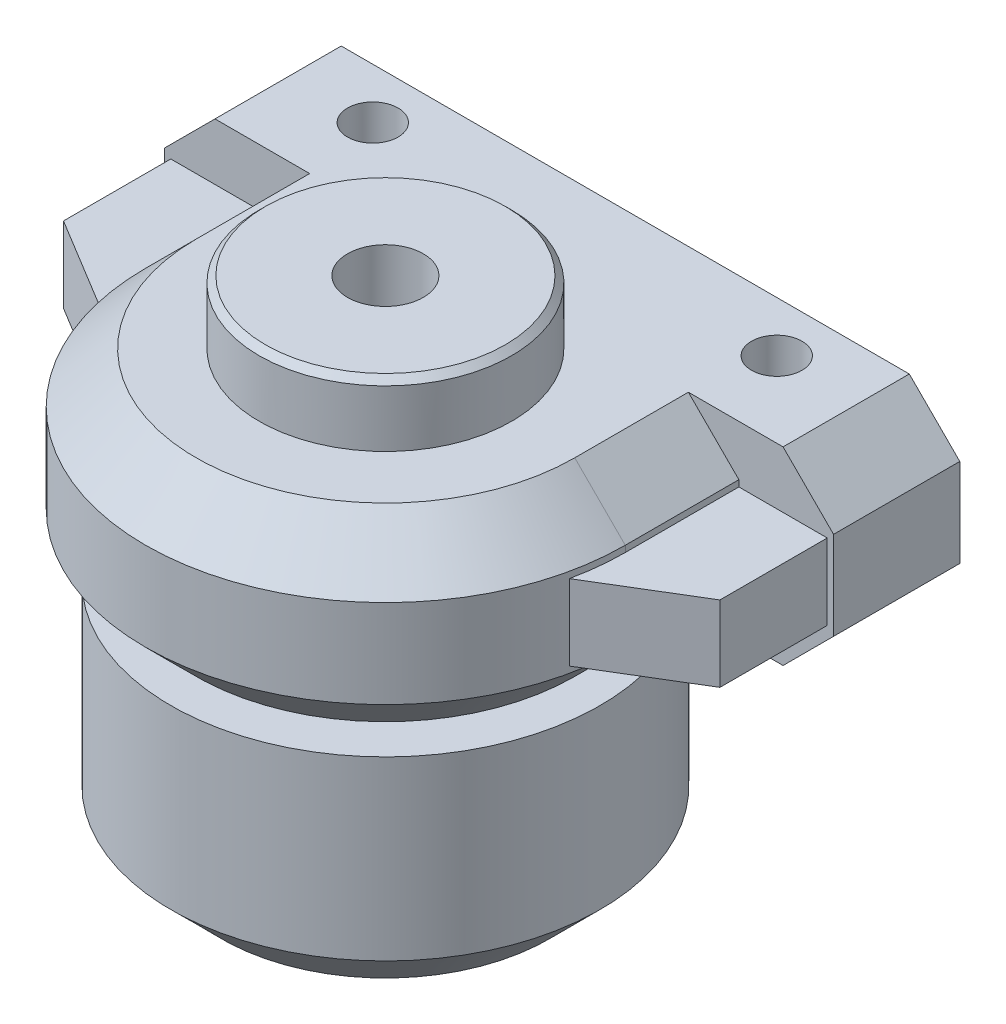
ISO-10303-21;
HEADER;
FILE_DESCRIPTION(('STEP AP214'),'2;1');
FILE_NAME('part.step','',(''),(''),'','','');
FILE_SCHEMA(('AUTOMOTIVE_DESIGN { 1 0 10303 214 1 1 1 1 }'));
ENDSEC;
DATA;
#1=APPLICATION_CONTEXT('core data for automotive mechanical design processes');
#2=APPLICATION_PROTOCOL_DEFINITION('international standard','automotive_design',2000,#1);
#3=PRODUCT_CONTEXT('',#1,'mechanical');
#4=PRODUCT('Part','Part','',(#3));
#5=PRODUCT_RELATED_PRODUCT_CATEGORY('part','',(#4));
#6=PRODUCT_DEFINITION_FORMATION('','',#4);
#7=PRODUCT_DEFINITION_CONTEXT('part definition',#1,'design');
#8=PRODUCT_DEFINITION('design','',#6,#7);
#9=PRODUCT_DEFINITION_SHAPE('','',#8);
#10=(LENGTH_UNIT() NAMED_UNIT(*) SI_UNIT(.MILLI.,.METRE.));
#11=(NAMED_UNIT(*) PLANE_ANGLE_UNIT() SI_UNIT($,.RADIAN.));
#12=(NAMED_UNIT(*) SI_UNIT($,.STERADIAN.) SOLID_ANGLE_UNIT());
#13=UNCERTAINTY_MEASURE_WITH_UNIT(LENGTH_MEASURE(1.E-05),#10,'distance_accuracy_value','');
#14=(GEOMETRIC_REPRESENTATION_CONTEXT(3) GLOBAL_UNCERTAINTY_ASSIGNED_CONTEXT((#13)) GLOBAL_UNIT_ASSIGNED_CONTEXT((#10,
#11,#12)) REPRESENTATION_CONTEXT('',''));
#15=CARTESIAN_POINT('',(0.,0.,0.));
#16=DIRECTION('',(0.,0.,1.));
#17=DIRECTION('',(1.,0.,0.));
#18=AXIS2_PLACEMENT_3D('',#15,#16,#17);
#19=CARTESIAN_POINT('',(0.,15.,10.));
#20=DIRECTION('',(0.,-1.,0.));
#21=DIRECTION('',(0.,0.,-1.));
#22=AXIS2_PLACEMENT_3D('',#19,#20,#21);
#23=PLANE('',#22);
#24=CARTESIAN_POINT('',(10.5,15.,4.));
#25=DIRECTION('',(0.,1.,0.));
#26=DIRECTION('',(0.,0.,-1.));
#27=AXIS2_PLACEMENT_3D('',#24,#25,#26);
#28=CIRCLE('',#27,2.);
#29=CARTESIAN_POINT('',(10.5,15.,2.));
#30=VERTEX_POINT('',#29);
#31=EDGE_CURVE('E346',#30,#30,#28,.T.);
#32=ORIENTED_EDGE('',*,*,#31,.F.);
#33=EDGE_LOOP('',(#32));
#34=FACE_BOUND('',#33,.T.);
#35=CARTESIAN_POINT('',(42.5,15.,4.));
#36=DIRECTION('',(0.,1.,0.));
#37=DIRECTION('',(0.,0.,1.));
#38=AXIS2_PLACEMENT_3D('',#35,#36,#37);
#39=CIRCLE('',#38,2.);
#40=CARTESIAN_POINT('',(42.5,15.,6.));
#41=VERTEX_POINT('',#40);
#42=EDGE_CURVE('E336',#41,#41,#39,.T.);
#43=ORIENTED_EDGE('',*,*,#42,.F.);
#44=EDGE_LOOP('',(#43));
#45=FACE_BOUND('',#44,.T.);
#46=DIRECTION('',(-1.,0.,0.));
#47=VECTOR('',#46,1.);
#48=CARTESIAN_POINT('',(0.,15.,10.));
#49=LINE('',#48,#47);
#50=CARTESIAN_POINT('',(49.,15.,10.));
#51=VERTEX_POINT('',#50);
#52=CARTESIAN_POINT('',(41.5,15.,10.));
#53=VERTEX_POINT('',#52);
#54=EDGE_CURVE('E416',#51,#53,#49,.T.);
#55=ORIENTED_EDGE('',*,*,#54,.F.);
#56=DIRECTION('',(0.,0.,-1.));
#57=VECTOR('',#56,1.);
#58=CARTESIAN_POINT('',(49.,15.,10.));
#59=LINE('',#58,#57);
#60=CARTESIAN_POINT('',(49.,15.,0.));
#61=VERTEX_POINT('',#60);
#62=EDGE_CURVE('E513',#51,#61,#59,.T.);
#63=ORIENTED_EDGE('',*,*,#62,.T.);
#64=DIRECTION('',(-1.,0.,0.));
#65=VECTOR('',#64,1.);
#66=CARTESIAN_POINT('',(0.,15.,0.));
#67=LINE('',#66,#65);
#68=CARTESIAN_POINT('',(4.00000000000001,15.,0.));
#69=VERTEX_POINT('',#68);
#70=EDGE_CURVE('E547',#61,#69,#67,.T.);
#71=ORIENTED_EDGE('',*,*,#70,.T.);
#72=DIRECTION('',(0.,0.,1.));
#73=VECTOR('',#72,1.);
#74=CARTESIAN_POINT('',(4.00000000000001,15.,10.));
#75=LINE('',#74,#73);
#76=CARTESIAN_POINT('',(4.00000000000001,15.,10.));
#77=VERTEX_POINT('',#76);
#78=EDGE_CURVE('E511',#69,#77,#75,.T.);
#79=ORIENTED_EDGE('',*,*,#78,.T.);
#80=CARTESIAN_POINT('',(11.5,15.,10.));
#81=VERTEX_POINT('',#80);
#82=EDGE_CURVE('E421',#81,#77,#49,.T.);
#83=ORIENTED_EDGE('',*,*,#82,.F.);
#84=DIRECTION('',(0.,0.,1.));
#85=VECTOR('',#84,1.);
#86=CARTESIAN_POINT('',(11.5,15.,19.));
#87=LINE('',#86,#85);
#88=CARTESIAN_POINT('',(11.5,15.,19.));
#89=VERTEX_POINT('',#88);
#90=EDGE_CURVE('E456',#81,#89,#87,.T.);
#91=ORIENTED_EDGE('',*,*,#90,.T.);
#92=CARTESIAN_POINT('',(26.5,15.,19.));
#93=DIRECTION('',(0.,-1.,0.));
#94=DIRECTION('',(0.,0.,-1.));
#95=AXIS2_PLACEMENT_3D('',#92,#93,#94);
#96=CIRCLE('',#95,15.);
#97=CARTESIAN_POINT('',(41.5,15.,19.));
#98=VERTEX_POINT('',#97);
#99=EDGE_CURVE('E460',#89,#98,#96,.F.);
#100=ORIENTED_EDGE('',*,*,#99,.T.);
#101=DIRECTION('',(0.,0.,-1.));
#102=VECTOR('',#101,1.);
#103=CARTESIAN_POINT('',(41.5,15.,10.));
#104=LINE('',#103,#102);
#105=EDGE_CURVE('E462',#98,#53,#104,.T.);
#106=ORIENTED_EDGE('',*,*,#105,.T.);
#107=EDGE_LOOP('',(#55,#63,#71,#79,#83,#91,#100,#106));
#108=FACE_BOUND('',#107,.T.);
#109=CARTESIAN_POINT('',(26.5,15.,19.));
#110=DIRECTION('',(0.,-1.,0.));
#111=DIRECTION('',(0.,0.,-1.));
#112=AXIS2_PLACEMENT_3D('',#109,#110,#111);
#113=CIRCLE('',#112,10.);
#114=CARTESIAN_POINT('',(26.5,15.,9.));
#115=VERTEX_POINT('',#114);
#116=EDGE_CURVE('E328',#115,#115,#113,.F.);
#117=ORIENTED_EDGE('',*,*,#116,.F.);
#118=EDGE_LOOP('',(#117));
#119=FACE_BOUND('',#118,.T.);
#120=ADVANCED_FACE('F24',(#34,#45,#108,#119),#23,.F.);
#121=CARTESIAN_POINT('',(0.,15.,10.));
#122=DIRECTION('',(0.,0.,-1.));
#123=DIRECTION('',(-1.,0.,0.));
#124=AXIS2_PLACEMENT_3D('',#121,#122,#123);
#125=PLANE('',#124);
#126=DIRECTION('',(-1.,0.,0.));
#127=VECTOR('',#126,1.);
#128=CARTESIAN_POINT('',(0.499999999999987,10.5,10.));
#129=LINE('',#128,#127);
#130=CARTESIAN_POINT('',(7.49999999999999,10.5,10.));
#131=VERTEX_POINT('',#130);
#132=CARTESIAN_POINT('',(0.499999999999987,10.5,10.));
#133=VERTEX_POINT('',#132);
#134=EDGE_CURVE('E238',#131,#133,#129,.T.);
#135=ORIENTED_EDGE('',*,*,#134,.F.);
#136=DIRECTION('',(0.,1.,0.));
#137=VECTOR('',#136,1.);
#138=CARTESIAN_POINT('',(7.49999999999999,0.,10.));
#139=LINE('',#138,#137);
#140=CARTESIAN_POINT('',(7.49999999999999,11.,10.));
#141=VERTEX_POINT('',#140);
#142=EDGE_CURVE('E322',#131,#141,#139,.T.);
#143=ORIENTED_EDGE('',*,*,#142,.T.);
#144=DIRECTION('',(0.707106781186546,0.707106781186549,0.));
#145=VECTOR('',#144,1.);
#146=CARTESIAN_POINT('',(5.75000000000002,9.25,10.));
#147=LINE('',#146,#145);
#148=EDGE_CURVE('E473',#141,#81,#147,.T.);
#149=ORIENTED_EDGE('',*,*,#148,.T.);
#150=ORIENTED_EDGE('',*,*,#82,.T.);
#151=DIRECTION('',(0.707106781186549,0.707106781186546,0.));
#152=VECTOR('',#151,1.);
#153=CARTESIAN_POINT('',(0.,11.,10.));
#154=LINE('',#153,#152);
#155=CARTESIAN_POINT('',(0.,11.,10.));
#156=VERTEX_POINT('',#155);
#157=EDGE_CURVE('E521',#77,#156,#154,.F.);
#158=ORIENTED_EDGE('',*,*,#157,.T.);
#159=DIRECTION('',(0.,-1.,0.));
#160=VECTOR('',#159,1.);
#161=CARTESIAN_POINT('',(0.,0.,10.));
#162=LINE('',#161,#160);
#163=CARTESIAN_POINT('',(0.,4.00000000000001,10.));
#164=VERTEX_POINT('',#163);
#165=EDGE_CURVE('E499',#156,#164,#162,.T.);
#166=ORIENTED_EDGE('',*,*,#165,.T.);
#167=DIRECTION('',(-0.707106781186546,0.707106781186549,0.));
#168=VECTOR('',#167,1.);
#169=CARTESIAN_POINT('',(4.,0.,10.));
#170=LINE('',#169,#168);
#171=CARTESIAN_POINT('',(4.,0.,10.));
#172=VERTEX_POINT('',#171);
#173=EDGE_CURVE('E331',#164,#172,#170,.F.);
#174=ORIENTED_EDGE('',*,*,#173,.T.);
#175=DIRECTION('',(1.,0.,0.));
#176=VECTOR('',#175,1.);
#177=CARTESIAN_POINT('',(0.,0.,10.));
#178=LINE('',#177,#176);
#179=CARTESIAN_POINT('',(11.5,0.,10.));
#180=VERTEX_POINT('',#179);
#181=EDGE_CURVE('E490',#172,#180,#178,.T.);
#182=ORIENTED_EDGE('',*,*,#181,.T.);
#183=DIRECTION('',(-0.707106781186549,0.707106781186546,0.));
#184=VECTOR('',#183,1.);
#185=CARTESIAN_POINT('',(-1.75000000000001,13.25,10.));
#186=LINE('',#185,#184);
#187=CARTESIAN_POINT('',(7.49999999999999,4.,10.));
#188=VERTEX_POINT('',#187);
#189=EDGE_CURVE('E468',#180,#188,#186,.T.);
#190=ORIENTED_EDGE('',*,*,#189,.T.);
#191=CARTESIAN_POINT('',(7.49999999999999,4.49999999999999,10.));
#192=VERTEX_POINT('',#191);
#193=EDGE_CURVE('E318',#188,#192,#139,.T.);
#194=ORIENTED_EDGE('',*,*,#193,.T.);
#195=DIRECTION('',(-1.,0.,0.));
#196=VECTOR('',#195,1.);
#197=CARTESIAN_POINT('',(0.499999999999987,4.49999999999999,10.));
#198=LINE('',#197,#196);
#199=CARTESIAN_POINT('',(0.499999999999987,4.49999999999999,10.));
#200=VERTEX_POINT('',#199);
#201=EDGE_CURVE('E46',#192,#200,#198,.T.);
#202=ORIENTED_EDGE('',*,*,#201,.T.);
#203=DIRECTION('',(0.,-1.,0.));
#204=VECTOR('',#203,1.);
#205=CARTESIAN_POINT('',(0.499999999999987,10.5,10.));
#206=LINE('',#205,#204);
#207=EDGE_CURVE('E41',#133,#200,#206,.T.);
#208=ORIENTED_EDGE('',*,*,#207,.F.);
#209=EDGE_LOOP('',(#135,#143,#149,#150,#158,#166,#174,#182,#190,#194,#202,#208));
#210=FACE_BOUND('',#209,.T.);
#211=ADVANCED_FACE('F374',(#210),#125,.F.);
#212=CARTESIAN_POINT('',(26.5,0.,19.));
#213=DIRECTION('',(0.,1.,0.));
#214=DIRECTION('',(0.,0.,1.));
#215=AXIS2_PLACEMENT_3D('',#212,#213,#214);
#216=CYLINDRICAL_SURFACE('',#215,19.);
#217=DIRECTION('',(0.,1.,0.));
#218=VECTOR('',#217,1.);
#219=CARTESIAN_POINT('',(7.49999999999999,0.,19.));
#220=LINE('',#219,#218);
#221=CARTESIAN_POINT('',(7.49999999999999,10.5,19.));
#222=VERTEX_POINT('',#221);
#223=CARTESIAN_POINT('',(7.49999999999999,11.,19.));
#224=VERTEX_POINT('',#223);
#225=EDGE_CURVE('E208',#222,#224,#220,.T.);
#226=ORIENTED_EDGE('',*,*,#225,.F.);
#227=CARTESIAN_POINT('',(26.5,10.5,19.));
#228=DIRECTION('',(0.,-1.,0.));
#229=DIRECTION('',(0.,0.,-1.));
#230=AXIS2_PLACEMENT_3D('',#227,#228,#229);
#231=CIRCLE('',#230,19.);
#232=CARTESIAN_POINT('',(7.92582437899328,10.5,23.));
#233=VERTEX_POINT('',#232);
#234=EDGE_CURVE('E232',#233,#222,#231,.T.);
#235=ORIENTED_EDGE('',*,*,#234,.F.);
#236=DIRECTION('',(0.,-1.,0.));
#237=VECTOR('',#236,1.);
#238=CARTESIAN_POINT('',(7.92582437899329,10.5,23.));
#239=LINE('',#238,#237);
#240=CARTESIAN_POINT('',(7.92582437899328,4.49999999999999,23.));
#241=VERTEX_POINT('',#240);
#242=EDGE_CURVE('E215',#233,#241,#239,.T.);
#243=ORIENTED_EDGE('',*,*,#242,.T.);
#244=CARTESIAN_POINT('',(26.5,4.49999999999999,19.));
#245=DIRECTION('',(0.,-1.,0.));
#246=DIRECTION('',(0.,0.,-1.));
#247=AXIS2_PLACEMENT_3D('',#244,#245,#246);
#248=CIRCLE('',#247,19.);
#249=CARTESIAN_POINT('',(7.49999999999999,4.49999999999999,19.));
#250=VERTEX_POINT('',#249);
#251=EDGE_CURVE('E211',#241,#250,#248,.T.);
#252=ORIENTED_EDGE('',*,*,#251,.T.);
#253=CARTESIAN_POINT('',(7.49999999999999,4.,19.));
#254=VERTEX_POINT('',#253);
#255=EDGE_CURVE('E197',#254,#250,#220,.T.);
#256=ORIENTED_EDGE('',*,*,#255,.F.);
#257=CARTESIAN_POINT('',(26.5,4.,19.));
#258=DIRECTION('',(0.,1.,0.));
#259=DIRECTION('',(0.,0.,1.));
#260=AXIS2_PLACEMENT_3D('',#257,#258,#259);
#261=CIRCLE('',#260,19.);
#262=CARTESIAN_POINT('',(45.5,4.,19.));
#263=VERTEX_POINT('',#262);
#264=EDGE_CURVE('E446',#254,#263,#261,.T.);
#265=ORIENTED_EDGE('',*,*,#264,.T.);
#266=DIRECTION('',(0.,1.,0.));
#267=VECTOR('',#266,1.);
#268=CARTESIAN_POINT('',(45.5,0.,19.));
#269=LINE('',#268,#267);
#270=CARTESIAN_POINT('',(45.5,4.49999999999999,19.));
#271=VERTEX_POINT('',#270);
#272=EDGE_CURVE('E553',#263,#271,#269,.T.);
#273=ORIENTED_EDGE('',*,*,#272,.T.);
#274=CARTESIAN_POINT('',(26.5,4.49999999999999,19.));
#275=DIRECTION('',(0.,-1.,0.));
#276=DIRECTION('',(0.,0.,1.));
#277=AXIS2_PLACEMENT_3D('',#274,#275,#276);
#278=CIRCLE('',#277,19.);
#279=CARTESIAN_POINT('',(45.0741756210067,4.49999999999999,23.));
#280=VERTEX_POINT('',#279);
#281=EDGE_CURVE('E255',#271,#280,#278,.T.);
#282=ORIENTED_EDGE('',*,*,#281,.T.);
#283=DIRECTION('',(0.,-1.,0.));
#284=VECTOR('',#283,1.);
#285=CARTESIAN_POINT('',(45.0741756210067,10.5,23.));
#286=LINE('',#285,#284);
#287=CARTESIAN_POINT('',(45.0741756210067,10.5,23.));
#288=VERTEX_POINT('',#287);
#289=EDGE_CURVE('E279',#288,#280,#286,.T.);
#290=ORIENTED_EDGE('',*,*,#289,.F.);
#291=CARTESIAN_POINT('',(26.5,10.5,19.));
#292=DIRECTION('',(0.,-1.,0.));
#293=DIRECTION('',(0.,0.,1.));
#294=AXIS2_PLACEMENT_3D('',#291,#292,#293);
#295=CIRCLE('',#294,19.);
#296=CARTESIAN_POINT('',(45.5,10.5,19.));
#297=VERTEX_POINT('',#296);
#298=EDGE_CURVE('E268',#297,#288,#295,.T.);
#299=ORIENTED_EDGE('',*,*,#298,.F.);
#300=CARTESIAN_POINT('',(45.5,11.,19.));
#301=VERTEX_POINT('',#300);
#302=EDGE_CURVE('E310',#297,#301,#269,.T.);
#303=ORIENTED_EDGE('',*,*,#302,.T.);
#304=CARTESIAN_POINT('',(26.5,11.,19.));
#305=DIRECTION('',(0.,-1.,0.));
#306=DIRECTION('',(0.,0.,-1.));
#307=AXIS2_PLACEMENT_3D('',#304,#305,#306);
#308=CIRCLE('',#307,19.);
#309=EDGE_CURVE('E444',#301,#224,#308,.T.);
#310=ORIENTED_EDGE('',*,*,#309,.T.);
#311=EDGE_LOOP('',(#226,#235,#243,#252,#256,#265,#273,#282,#290,#299,#303,#310));
#312=FACE_BOUND('',#311,.T.);
#313=ADVANCED_FACE('F213',(#312),#216,.T.);
#314=CARTESIAN_POINT('',(7.49999999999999,0.,10.));
#315=DIRECTION('',(-1.,0.,0.));
#316=DIRECTION('',(0.,0.,1.));
#317=AXIS2_PLACEMENT_3D('',#314,#315,#316);
#318=PLANE('',#317);
#319=ORIENTED_EDGE('',*,*,#142,.F.);
#320=DIRECTION('',(0.,0.,-1.));
#321=VECTOR('',#320,1.);
#322=CARTESIAN_POINT('',(7.49999999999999,10.5,10.));
#323=LINE('',#322,#321);
#324=EDGE_CURVE('E235',#222,#131,#323,.T.);
#325=ORIENTED_EDGE('',*,*,#324,.F.);
#326=ORIENTED_EDGE('',*,*,#225,.T.);
#327=DIRECTION('',(0.,0.,-1.));
#328=VECTOR('',#327,1.);
#329=CARTESIAN_POINT('',(7.49999999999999,11.,10.));
#330=LINE('',#329,#328);
#331=EDGE_CURVE('E447',#224,#141,#330,.T.);
#332=ORIENTED_EDGE('',*,*,#331,.T.);
#333=EDGE_LOOP('',(#319,#325,#326,#332));
#334=FACE_BOUND('',#333,.T.);
#335=ADVANCED_FACE('F399',(#334),#318,.T.);
#336=CARTESIAN_POINT('',(45.5,0.,10.));
#337=DIRECTION('',(1.,0.,0.));
#338=DIRECTION('',(0.,0.,-1.));
#339=AXIS2_PLACEMENT_3D('',#336,#337,#338);
#340=PLANE('',#339);
#341=DIRECTION('',(0.,1.,0.));
#342=VECTOR('',#341,1.);
#343=CARTESIAN_POINT('',(45.5,0.,10.));
#344=LINE('',#343,#342);
#345=CARTESIAN_POINT('',(45.5,4.,10.));
#346=VERTEX_POINT('',#345);
#347=CARTESIAN_POINT('',(45.5,4.49999999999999,10.));
#348=VERTEX_POINT('',#347);
#349=EDGE_CURVE('E325',#346,#348,#344,.T.);
#350=ORIENTED_EDGE('',*,*,#349,.T.);
#351=DIRECTION('',(0.,0.,1.));
#352=VECTOR('',#351,1.);
#353=CARTESIAN_POINT('',(45.5,4.49999999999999,10.));
#354=LINE('',#353,#352);
#355=EDGE_CURVE('E252',#348,#271,#354,.T.);
#356=ORIENTED_EDGE('',*,*,#355,.T.);
#357=ORIENTED_EDGE('',*,*,#272,.F.);
#358=DIRECTION('',(0.,0.,-1.));
#359=VECTOR('',#358,1.);
#360=CARTESIAN_POINT('',(45.5,4.,10.));
#361=LINE('',#360,#359);
#362=EDGE_CURVE('E434',#263,#346,#361,.T.);
#363=ORIENTED_EDGE('',*,*,#362,.T.);
#364=EDGE_LOOP('',(#350,#356,#357,#363));
#365=FACE_BOUND('',#364,.T.);
#366=ADVANCED_FACE('F392',(#365),#340,.T.);
#367=CARTESIAN_POINT('',(0.,0.,10.));
#368=DIRECTION('',(0.,1.,0.));
#369=DIRECTION('',(0.,0.,1.));
#370=AXIS2_PLACEMENT_3D('',#367,#368,#369);
#371=PLANE('',#370);
#372=CARTESIAN_POINT('',(10.5,0.,4.));
#373=DIRECTION('',(0.,1.,0.));
#374=DIRECTION('',(0.,0.,1.));
#375=AXIS2_PLACEMENT_3D('',#372,#373,#374);
#376=CIRCLE('',#375,2.);
#377=CARTESIAN_POINT('',(10.5,0.,6.));
#378=VERTEX_POINT('',#377);
#379=EDGE_CURVE('E28',#378,#378,#376,.T.);
#380=ORIENTED_EDGE('',*,*,#379,.T.);
#381=EDGE_LOOP('',(#380));
#382=FACE_BOUND('',#381,.T.);
#383=CARTESIAN_POINT('',(42.5,0.,4.));
#384=DIRECTION('',(0.,1.,0.));
#385=DIRECTION('',(0.,0.,1.));
#386=AXIS2_PLACEMENT_3D('',#383,#384,#385);
#387=CIRCLE('',#386,2.);
#388=CARTESIAN_POINT('',(42.5,0.,6.));
#389=VERTEX_POINT('',#388);
#390=EDGE_CURVE('E333',#389,#389,#387,.T.);
#391=ORIENTED_EDGE('',*,*,#390,.T.);
#392=EDGE_LOOP('',(#391));
#393=FACE_BOUND('',#392,.T.);
#394=DIRECTION('',(1.,0.,0.));
#395=VECTOR('',#394,1.);
#396=CARTESIAN_POINT('',(0.,0.,0.));
#397=LINE('',#396,#395);
#398=CARTESIAN_POINT('',(4.,0.,0.));
#399=VERTEX_POINT('',#398);
#400=CARTESIAN_POINT('',(49.,0.,0.));
#401=VERTEX_POINT('',#400);
#402=EDGE_CURVE('E409',#399,#401,#397,.T.);
#403=ORIENTED_EDGE('',*,*,#402,.T.);
#404=DIRECTION('',(0.,0.,1.));
#405=VECTOR('',#404,1.);
#406=CARTESIAN_POINT('',(49.,0.,10.));
#407=LINE('',#406,#405);
#408=CARTESIAN_POINT('',(49.,0.,10.));
#409=VERTEX_POINT('',#408);
#410=EDGE_CURVE('E506',#401,#409,#407,.T.);
#411=ORIENTED_EDGE('',*,*,#410,.T.);
#412=CARTESIAN_POINT('',(41.5,0.,10.));
#413=VERTEX_POINT('',#412);
#414=EDGE_CURVE('E494',#413,#409,#178,.T.);
#415=ORIENTED_EDGE('',*,*,#414,.F.);
#416=DIRECTION('',(0.,0.,1.));
#417=VECTOR('',#416,1.);
#418=CARTESIAN_POINT('',(41.5,0.,19.));
#419=LINE('',#418,#417);
#420=CARTESIAN_POINT('',(41.5,0.,19.));
#421=VERTEX_POINT('',#420);
#422=EDGE_CURVE('E442',#413,#421,#419,.T.);
#423=ORIENTED_EDGE('',*,*,#422,.T.);
#424=CARTESIAN_POINT('',(26.5,0.,19.));
#425=DIRECTION('',(0.,1.,0.));
#426=DIRECTION('',(0.,0.,1.));
#427=AXIS2_PLACEMENT_3D('',#424,#425,#426);
#428=CIRCLE('',#427,15.);
#429=CARTESIAN_POINT('',(11.5,0.,19.));
#430=VERTEX_POINT('',#429);
#431=EDGE_CURVE('E440',#421,#430,#428,.F.);
#432=ORIENTED_EDGE('',*,*,#431,.T.);
#433=DIRECTION('',(0.,0.,-1.));
#434=VECTOR('',#433,1.);
#435=CARTESIAN_POINT('',(11.5,0.,10.));
#436=LINE('',#435,#434);
#437=EDGE_CURVE('E437',#430,#180,#436,.T.);
#438=ORIENTED_EDGE('',*,*,#437,.T.);
#439=ORIENTED_EDGE('',*,*,#181,.F.);
#440=DIRECTION('',(0.,0.,-1.));
#441=VECTOR('',#440,1.);
#442=CARTESIAN_POINT('',(4.,0.,10.));
#443=LINE('',#442,#441);
#444=EDGE_CURVE('E489',#172,#399,#443,.T.);
#445=ORIENTED_EDGE('',*,*,#444,.T.);
#446=EDGE_LOOP('',(#403,#411,#415,#423,#432,#438,#439,#445));
#447=FACE_BOUND('',#446,.T.);
#448=CARTESIAN_POINT('',(26.5,0.,19.));
#449=DIRECTION('',(0.,1.,0.));
#450=DIRECTION('',(0.,0.,1.));
#451=AXIS2_PLACEMENT_3D('',#448,#449,#450);
#452=CIRCLE('',#451,9.5);
#453=CARTESIAN_POINT('',(26.5,0.,28.5));
#454=VERTEX_POINT('',#453);
#455=EDGE_CURVE('E413',#454,#454,#452,.F.);
#456=ORIENTED_EDGE('',*,*,#455,.F.);
#457=EDGE_LOOP('',(#456));
#458=FACE_BOUND('',#457,.T.);
#459=ADVANCED_FACE('F390',(#382,#393,#447,#458),#371,.F.);
#460=CARTESIAN_POINT('',(45.5,10.5,10.));
#461=VERTEX_POINT('',#460);
#462=CARTESIAN_POINT('',(45.5,11.,10.));
#463=VERTEX_POINT('',#462);
#464=EDGE_CURVE('E326',#461,#463,#344,.T.);
#465=ORIENTED_EDGE('',*,*,#464,.F.);
#466=DIRECTION('',(-1.,0.,0.));
#467=VECTOR('',#466,1.);
#468=CARTESIAN_POINT('',(52.5,10.5,10.));
#469=LINE('',#468,#467);
#470=CARTESIAN_POINT('',(52.5,10.5,10.));
#471=VERTEX_POINT('',#470);
#472=EDGE_CURVE('E264',#471,#461,#469,.T.);
#473=ORIENTED_EDGE('',*,*,#472,.F.);
#474=DIRECTION('',(0.,-1.,0.));
#475=VECTOR('',#474,1.);
#476=CARTESIAN_POINT('',(52.5,10.5,10.));
#477=LINE('',#476,#475);
#478=CARTESIAN_POINT('',(52.5,4.49999999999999,10.));
#479=VERTEX_POINT('',#478);
#480=EDGE_CURVE('E274',#471,#479,#477,.T.);
#481=ORIENTED_EDGE('',*,*,#480,.T.);
#482=DIRECTION('',(-1.,0.,0.));
#483=VECTOR('',#482,1.);
#484=CARTESIAN_POINT('',(52.5,4.49999999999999,10.));
#485=LINE('',#484,#483);
#486=EDGE_CURVE('E249',#479,#348,#485,.T.);
#487=ORIENTED_EDGE('',*,*,#486,.T.);
#488=ORIENTED_EDGE('',*,*,#349,.F.);
#489=DIRECTION('',(-0.707106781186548,-0.707106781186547,0.));
#490=VECTOR('',#489,1.);
#491=CARTESIAN_POINT('',(28.2499999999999,-13.25,10.));
#492=LINE('',#491,#490);
#493=EDGE_CURVE('E465',#346,#413,#492,.T.);
#494=ORIENTED_EDGE('',*,*,#493,.T.);
#495=ORIENTED_EDGE('',*,*,#414,.T.);
#496=DIRECTION('',(-0.707106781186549,-0.707106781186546,0.));
#497=VECTOR('',#496,1.);
#498=CARTESIAN_POINT('',(53.,4.,10.));
#499=LINE('',#498,#497);
#500=CARTESIAN_POINT('',(53.,4.,10.));
#501=VERTEX_POINT('',#500);
#502=EDGE_CURVE('E509',#409,#501,#499,.F.);
#503=ORIENTED_EDGE('',*,*,#502,.T.);
#504=DIRECTION('',(0.,1.,0.));
#505=VECTOR('',#504,1.);
#506=CARTESIAN_POINT('',(53.,0.,10.));
#507=LINE('',#506,#505);
#508=CARTESIAN_POINT('',(53.,11.,10.));
#509=VERTEX_POINT('',#508);
#510=EDGE_CURVE('E493',#501,#509,#507,.T.);
#511=ORIENTED_EDGE('',*,*,#510,.T.);
#512=DIRECTION('',(0.707106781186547,-0.707106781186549,0.));
#513=VECTOR('',#512,1.);
#514=CARTESIAN_POINT('',(49.,15.,10.));
#515=LINE('',#514,#513);
#516=EDGE_CURVE('E507',#509,#51,#515,.F.);
#517=ORIENTED_EDGE('',*,*,#516,.T.);
#518=ORIENTED_EDGE('',*,*,#54,.T.);
#519=DIRECTION('',(0.707106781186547,-0.707106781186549,0.));
#520=VECTOR('',#519,1.);
#521=CARTESIAN_POINT('',(20.7500000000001,35.75,10.));
#522=LINE('',#521,#520);
#523=EDGE_CURVE('E470',#53,#463,#522,.T.);
#524=ORIENTED_EDGE('',*,*,#523,.T.);
#525=EDGE_LOOP('',(#465,#473,#481,#487,#488,#494,#495,#503,#511,#517,#518,#524));
#526=FACE_BOUND('',#525,.T.);
#527=ADVANCED_FACE('F381',(#526),#125,.F.);
#528=CARTESIAN_POINT('',(0.,0.,10.));
#529=DIRECTION('',(1.,0.,0.));
#530=DIRECTION('',(0.,0.,-1.));
#531=AXIS2_PLACEMENT_3D('',#528,#529,#530);
#532=PLANE('',#531);
#533=DIRECTION('',(0.,-1.,0.));
#534=VECTOR('',#533,1.);
#535=CARTESIAN_POINT('',(0.,0.,0.));
#536=LINE('',#535,#534);
#537=CARTESIAN_POINT('',(0.,11.,0.));
#538=VERTEX_POINT('',#537);
#539=CARTESIAN_POINT('',(0.,4.00000000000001,0.));
#540=VERTEX_POINT('',#539);
#541=EDGE_CURVE('E207',#538,#540,#536,.T.);
#542=ORIENTED_EDGE('',*,*,#541,.T.);
#543=DIRECTION('',(0.,0.,1.));
#544=VECTOR('',#543,1.);
#545=CARTESIAN_POINT('',(0.,4.00000000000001,10.));
#546=LINE('',#545,#544);
#547=EDGE_CURVE('E519',#540,#164,#546,.T.);
#548=ORIENTED_EDGE('',*,*,#547,.T.);
#549=ORIENTED_EDGE('',*,*,#165,.F.);
#550=DIRECTION('',(0.,0.,-1.));
#551=VECTOR('',#550,1.);
#552=CARTESIAN_POINT('',(0.,11.,10.));
#553=LINE('',#552,#551);
#554=EDGE_CURVE('E516',#156,#538,#553,.T.);
#555=ORIENTED_EDGE('',*,*,#554,.T.);
#556=EDGE_LOOP('',(#542,#548,#549,#555));
#557=FACE_BOUND('',#556,.T.);
#558=ADVANCED_FACE('F26',(#557),#532,.F.);
#559=CARTESIAN_POINT('',(53.,0.,10.));
#560=DIRECTION('',(-1.,0.,0.));
#561=DIRECTION('',(0.,0.,1.));
#562=AXIS2_PLACEMENT_3D('',#559,#560,#561);
#563=PLANE('',#562);
#564=ORIENTED_EDGE('',*,*,#510,.F.);
#565=DIRECTION('',(0.,0.,-1.));
#566=VECTOR('',#565,1.);
#567=CARTESIAN_POINT('',(53.,4.,10.));
#568=LINE('',#567,#566);
#569=CARTESIAN_POINT('',(53.,4.,0.));
#570=VERTEX_POINT('',#569);
#571=EDGE_CURVE('E478',#501,#570,#568,.T.);
#572=ORIENTED_EDGE('',*,*,#571,.T.);
#573=DIRECTION('',(0.,1.,0.));
#574=VECTOR('',#573,1.);
#575=CARTESIAN_POINT('',(53.,0.,0.));
#576=LINE('',#575,#574);
#577=CARTESIAN_POINT('',(53.,11.,0.));
#578=VERTEX_POINT('',#577);
#579=EDGE_CURVE('E543',#570,#578,#576,.T.);
#580=ORIENTED_EDGE('',*,*,#579,.T.);
#581=DIRECTION('',(0.,0.,1.));
#582=VECTOR('',#581,1.);
#583=CARTESIAN_POINT('',(53.,11.,10.));
#584=LINE('',#583,#582);
#585=EDGE_CURVE('E476',#578,#509,#584,.T.);
#586=ORIENTED_EDGE('',*,*,#585,.T.);
#587=EDGE_LOOP('',(#564,#572,#580,#586));
#588=FACE_BOUND('',#587,.T.);
#589=ADVANCED_FACE('F386',(#588),#563,.F.);
#590=CARTESIAN_POINT('',(0.,15.,0.));
#591=DIRECTION('',(0.,0.,-1.));
#592=DIRECTION('',(-1.,0.,0.));
#593=AXIS2_PLACEMENT_3D('',#590,#591,#592);
#594=PLANE('',#593);
#595=CARTESIAN_POINT('',(47.5,7.5,0.));
#596=DIRECTION('',(0.,0.,-1.));
#597=DIRECTION('',(1.,0.,0.));
#598=AXIS2_PLACEMENT_3D('',#595,#596,#597);
#599=CIRCLE('',#598,1.5);
#600=CARTESIAN_POINT('',(49.,7.5,0.));
#601=VERTEX_POINT('',#600);
#602=EDGE_CURVE('E281',#601,#601,#599,.T.);
#603=ORIENTED_EDGE('',*,*,#602,.F.);
#604=EDGE_LOOP('',(#603));
#605=FACE_BOUND('',#604,.T.);
#606=CARTESIAN_POINT('',(5.5,7.5,0.));
#607=DIRECTION('',(0.,0.,-1.));
#608=DIRECTION('',(-1.,0.,0.));
#609=AXIS2_PLACEMENT_3D('',#606,#607,#608);
#610=CIRCLE('',#609,1.5);
#611=CARTESIAN_POINT('',(4.,7.5,0.));
#612=VERTEX_POINT('',#611);
#613=EDGE_CURVE('E287',#612,#612,#610,.T.);
#614=ORIENTED_EDGE('',*,*,#613,.F.);
#615=EDGE_LOOP('',(#614));
#616=FACE_BOUND('',#615,.T.);
#617=ORIENTED_EDGE('',*,*,#579,.F.);
#618=DIRECTION('',(0.707106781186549,0.707106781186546,0.));
#619=VECTOR('',#618,1.);
#620=CARTESIAN_POINT('',(31.9999999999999,-17.,0.));
#621=LINE('',#620,#619);
#622=EDGE_CURVE('E487',#570,#401,#621,.F.);
#623=ORIENTED_EDGE('',*,*,#622,.T.);
#624=ORIENTED_EDGE('',*,*,#402,.F.);
#625=DIRECTION('',(0.707106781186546,-0.707106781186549,0.));
#626=VECTOR('',#625,1.);
#627=CARTESIAN_POINT('',(-5.49999999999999,9.50000000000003,0.));
#628=LINE('',#627,#626);
#629=EDGE_CURVE('E483',#399,#540,#628,.F.);
#630=ORIENTED_EDGE('',*,*,#629,.T.);
#631=ORIENTED_EDGE('',*,*,#541,.F.);
#632=DIRECTION('',(-0.707106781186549,-0.707106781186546,0.));
#633=VECTOR('',#632,1.);
#634=CARTESIAN_POINT('',(2.,13.,0.));
#635=LINE('',#634,#633);
#636=EDGE_CURVE('E481',#538,#69,#635,.F.);
#637=ORIENTED_EDGE('',*,*,#636,.T.);
#638=ORIENTED_EDGE('',*,*,#70,.F.);
#639=DIRECTION('',(-0.707106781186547,0.707106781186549,0.));
#640=VECTOR('',#639,1.);
#641=CARTESIAN_POINT('',(24.5000000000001,39.5,0.));
#642=LINE('',#641,#640);
#643=EDGE_CURVE('E485',#61,#578,#642,.F.);
#644=ORIENTED_EDGE('',*,*,#643,.T.);
#645=EDGE_LOOP('',(#617,#623,#624,#630,#631,#637,#638,#644));
#646=FACE_BOUND('',#645,.T.);
#647=ADVANCED_FACE('F388',(#605,#616,#646),#594,.T.);
#648=DIRECTION('',(0.,0.,-1.));
#649=VECTOR('',#648,1.);
#650=CARTESIAN_POINT('',(7.49999999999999,4.49999999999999,10.));
#651=LINE('',#650,#649);
#652=EDGE_CURVE('E202',#250,#192,#651,.T.);
#653=ORIENTED_EDGE('',*,*,#652,.T.);
#654=ORIENTED_EDGE('',*,*,#193,.F.);
#655=DIRECTION('',(0.,0.,1.));
#656=VECTOR('',#655,1.);
#657=CARTESIAN_POINT('',(7.49999999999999,4.,19.));
#658=LINE('',#657,#656);
#659=EDGE_CURVE('E204',#188,#254,#658,.T.);
#660=ORIENTED_EDGE('',*,*,#659,.T.);
#661=ORIENTED_EDGE('',*,*,#255,.T.);
#662=EDGE_LOOP('',(#653,#654,#660,#661));
#663=FACE_BOUND('',#662,.T.);
#664=ADVANCED_FACE('F199',(#663),#318,.T.);
#665=DIRECTION('',(0.,0.,1.));
#666=VECTOR('',#665,1.);
#667=CARTESIAN_POINT('',(45.5,10.5,10.));
#668=LINE('',#667,#666);
#669=EDGE_CURVE('E266',#461,#297,#668,.T.);
#670=ORIENTED_EDGE('',*,*,#669,.F.);
#671=ORIENTED_EDGE('',*,*,#464,.T.);
#672=DIRECTION('',(0.,0.,1.));
#673=VECTOR('',#672,1.);
#674=CARTESIAN_POINT('',(45.5,11.,19.));
#675=LINE('',#674,#673);
#676=EDGE_CURVE('E429',#463,#301,#675,.T.);
#677=ORIENTED_EDGE('',*,*,#676,.T.);
#678=ORIENTED_EDGE('',*,*,#302,.F.);
#679=EDGE_LOOP('',(#670,#671,#677,#678));
#680=FACE_BOUND('',#679,.T.);
#681=ADVANCED_FACE('F402',(#680),#340,.T.);
#682=CARTESIAN_POINT('',(26.5,-1.,19.));
#683=DIRECTION('',(0.,1.,0.));
#684=DIRECTION('',(0.,0.,1.));
#685=AXIS2_PLACEMENT_3D('',#682,#683,#684);
#686=CYLINDRICAL_SURFACE('',#685,9.5);
#687=CARTESIAN_POINT('',(26.5,-1.,19.));
#688=DIRECTION('',(0.,-1.,0.));
#689=DIRECTION('',(0.,0.,-1.));
#690=AXIS2_PLACEMENT_3D('',#687,#688,#689);
#691=CIRCLE('',#690,9.5);
#692=CARTESIAN_POINT('',(26.5,-1.,9.5));
#693=VERTEX_POINT('',#692);
#694=EDGE_CURVE('E308',#693,#693,#691,.T.);
#695=ORIENTED_EDGE('',*,*,#694,.F.);
#696=EDGE_LOOP('',(#695));
#697=FACE_BOUND('',#696,.T.);
#698=ORIENTED_EDGE('',*,*,#455,.T.);
#699=EDGE_LOOP('',(#698));
#700=FACE_BOUND('',#699,.T.);
#701=ADVANCED_FACE('F647',(#697,#700),#686,.T.);
#702=CARTESIAN_POINT('',(26.5,-1.,19.));
#703=DIRECTION('',(0.,-1.,0.));
#704=DIRECTION('',(0.,0.,-1.));
#705=AXIS2_PLACEMENT_3D('',#702,#703,#704);
#706=PLANE('',#705);
#707=CARTESIAN_POINT('',(26.5,-1.,19.));
#708=DIRECTION('',(0.,-1.,0.));
#709=DIRECTION('',(0.,0.,-1.));
#710=AXIS2_PLACEMENT_3D('',#707,#708,#709);
#711=CIRCLE('',#710,17.);
#712=CARTESIAN_POINT('',(26.5,-1.,2.));
#713=VERTEX_POINT('',#712);
#714=EDGE_CURVE('E305',#713,#713,#711,.T.);
#715=ORIENTED_EDGE('',*,*,#714,.F.);
#716=EDGE_LOOP('',(#715));
#717=FACE_BOUND('',#716,.T.);
#718=ORIENTED_EDGE('',*,*,#694,.T.);
#719=EDGE_LOOP('',(#718));
#720=FACE_BOUND('',#719,.T.);
#721=ADVANCED_FACE('F653',(#717,#720),#706,.F.);
#722=CARTESIAN_POINT('',(26.5,-19.,19.));
#723=DIRECTION('',(0.,1.,0.));
#724=DIRECTION('',(0.,0.,1.));
#725=AXIS2_PLACEMENT_3D('',#722,#723,#724);
#726=CYLINDRICAL_SURFACE('',#725,17.);
#727=CARTESIAN_POINT('',(26.5,-15.,19.));
#728=DIRECTION('',(0.,-1.,0.));
#729=DIRECTION('',(0.,0.,-1.));
#730=AXIS2_PLACEMENT_3D('',#727,#728,#729);
#731=CIRCLE('',#730,17.);
#732=CARTESIAN_POINT('',(26.5,-15.,2.));
#733=VERTEX_POINT('',#732);
#734=EDGE_CURVE('E419',#733,#733,#731,.F.);
#735=ORIENTED_EDGE('',*,*,#734,.T.);
#736=EDGE_LOOP('',(#735));
#737=FACE_BOUND('',#736,.T.);
#738=ORIENTED_EDGE('',*,*,#714,.T.);
#739=EDGE_LOOP('',(#738));
#740=FACE_BOUND('',#739,.T.);
#741=ADVANCED_FACE('F662',(#737,#740),#726,.T.);
#742=CARTESIAN_POINT('',(26.5,-19.,19.));
#743=DIRECTION('',(0.,-1.,0.));
#744=DIRECTION('',(0.,0.,-1.));
#745=AXIS2_PLACEMENT_3D('',#742,#743,#744);
#746=PLANE('',#745);
#747=CARTESIAN_POINT('',(26.5,-19.,19.));
#748=DIRECTION('',(0.,-1.,0.));
#749=DIRECTION('',(0.,0.,-1.));
#750=AXIS2_PLACEMENT_3D('',#747,#748,#749);
#751=CIRCLE('',#750,13.);
#752=CARTESIAN_POINT('',(26.5,-19.,6.));
#753=VERTEX_POINT('',#752);
#754=EDGE_CURVE('E415',#753,#753,#751,.T.);
#755=ORIENTED_EDGE('',*,*,#754,.T.);
#756=EDGE_LOOP('',(#755));
#757=FACE_BOUND('',#756,.T.);
#758=ADVANCED_FACE('F671',(#757),#746,.T.);
#759=CARTESIAN_POINT('',(26.5,-19.,19.));
#760=DIRECTION('',(0.,1.,0.));
#761=DIRECTION('',(0.,0.,1.));
#762=AXIS2_PLACEMENT_3D('',#759,#760,#761);
#763=CONICAL_SURFACE('',#762,13.,0.785398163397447);
#764=ORIENTED_EDGE('',*,*,#734,.F.);
#765=EDGE_LOOP('',(#764));
#766=FACE_BOUND('',#765,.T.);
#767=ORIENTED_EDGE('',*,*,#754,.F.);
#768=EDGE_LOOP('',(#767));
#769=FACE_BOUND('',#768,.T.);
#770=ADVANCED_FACE('F678',(#766,#769),#763,.T.);
#771=CARTESIAN_POINT('',(7.49999999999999,4.,10.));
#772=DIRECTION('',(-0.707106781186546,-0.707106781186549,0.));
#773=DIRECTION('',(0.707106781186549,-0.707106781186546,0.));
#774=AXIS2_PLACEMENT_3D('',#771,#772,#773);
#775=PLANE('',#774);
#776=ORIENTED_EDGE('',*,*,#189,.F.);
#777=ORIENTED_EDGE('',*,*,#437,.F.);
#778=DIRECTION('',(0.707106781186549,-0.707106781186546,0.));
#779=VECTOR('',#778,1.);
#780=CARTESIAN_POINT('',(7.49999999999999,4.,19.));
#781=LINE('',#780,#779);
#782=EDGE_CURVE('E302',#254,#430,#781,.T.);
#783=ORIENTED_EDGE('',*,*,#782,.F.);
#784=ORIENTED_EDGE('',*,*,#659,.F.);
#785=EDGE_LOOP('',(#776,#777,#783,#784));
#786=FACE_BOUND('',#785,.T.);
#787=ADVANCED_FACE('F584',(#786),#775,.T.);
#788=CARTESIAN_POINT('',(26.5,4.,19.));
#789=DIRECTION('',(0.,1.,0.));
#790=DIRECTION('',(0.,0.,1.));
#791=AXIS2_PLACEMENT_3D('',#788,#789,#790);
#792=CONICAL_SURFACE('',#791,19.,0.78539816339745);
#793=ORIENTED_EDGE('',*,*,#782,.T.);
#794=ORIENTED_EDGE('',*,*,#431,.F.);
#795=DIRECTION('',(-0.707106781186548,-0.707106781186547,0.));
#796=VECTOR('',#795,1.);
#797=CARTESIAN_POINT('',(45.5,4.,19.));
#798=LINE('',#797,#796);
#799=EDGE_CURVE('E299',#263,#421,#798,.T.);
#800=ORIENTED_EDGE('',*,*,#799,.F.);
#801=ORIENTED_EDGE('',*,*,#264,.F.);
#802=EDGE_LOOP('',(#793,#794,#800,#801));
#803=FACE_BOUND('',#802,.T.);
#804=ADVANCED_FACE('F588',(#803),#792,.T.);
#805=CARTESIAN_POINT('',(45.5,4.,10.));
#806=DIRECTION('',(0.707106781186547,-0.707106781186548,0.));
#807=DIRECTION('',(0.707106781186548,0.707106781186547,0.));
#808=AXIS2_PLACEMENT_3D('',#805,#806,#807);
#809=PLANE('',#808);
#810=ORIENTED_EDGE('',*,*,#799,.T.);
#811=ORIENTED_EDGE('',*,*,#422,.F.);
#812=ORIENTED_EDGE('',*,*,#493,.F.);
#813=ORIENTED_EDGE('',*,*,#362,.F.);
#814=EDGE_LOOP('',(#810,#811,#812,#813));
#815=FACE_BOUND('',#814,.T.);
#816=ADVANCED_FACE('F591',(#815),#809,.T.);
#817=CARTESIAN_POINT('',(11.5,15.,10.));
#818=DIRECTION('',(-0.707106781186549,0.707106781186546,0.));
#819=DIRECTION('',(-0.707106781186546,-0.707106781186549,0.));
#820=AXIS2_PLACEMENT_3D('',#817,#818,#819);
#821=PLANE('',#820);
#822=ORIENTED_EDGE('',*,*,#148,.F.);
#823=ORIENTED_EDGE('',*,*,#331,.F.);
#824=DIRECTION('',(-0.707106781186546,-0.707106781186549,0.));
#825=VECTOR('',#824,1.);
#826=CARTESIAN_POINT('',(11.5,15.,19.));
#827=LINE('',#826,#825);
#828=EDGE_CURVE('E296',#89,#224,#827,.T.);
#829=ORIENTED_EDGE('',*,*,#828,.F.);
#830=ORIENTED_EDGE('',*,*,#90,.F.);
#831=EDGE_LOOP('',(#822,#823,#829,#830));
#832=FACE_BOUND('',#831,.T.);
#833=ADVANCED_FACE('F577',(#832),#821,.T.);
#834=CARTESIAN_POINT('',(26.5,15.,19.));
#835=DIRECTION('',(0.,-1.,0.));
#836=DIRECTION('',(0.,0.,-1.));
#837=AXIS2_PLACEMENT_3D('',#834,#835,#836);
#838=CONICAL_SURFACE('',#837,15.,0.785398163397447);
#839=ORIENTED_EDGE('',*,*,#828,.T.);
#840=ORIENTED_EDGE('',*,*,#309,.F.);
#841=DIRECTION('',(0.707106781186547,-0.707106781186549,0.));
#842=VECTOR('',#841,1.);
#843=CARTESIAN_POINT('',(41.5,15.,19.));
#844=LINE('',#843,#842);
#845=EDGE_CURVE('E293',#98,#301,#844,.T.);
#846=ORIENTED_EDGE('',*,*,#845,.F.);
#847=ORIENTED_EDGE('',*,*,#99,.F.);
#848=EDGE_LOOP('',(#839,#840,#846,#847));
#849=FACE_BOUND('',#848,.T.);
#850=ADVANCED_FACE('F565',(#849),#838,.T.);
#851=CARTESIAN_POINT('',(41.5,15.,10.));
#852=DIRECTION('',(0.707106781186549,0.707106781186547,0.));
#853=DIRECTION('',(-0.707106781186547,0.707106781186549,0.));
#854=AXIS2_PLACEMENT_3D('',#851,#852,#853);
#855=PLANE('',#854);
#856=ORIENTED_EDGE('',*,*,#845,.T.);
#857=ORIENTED_EDGE('',*,*,#676,.F.);
#858=ORIENTED_EDGE('',*,*,#523,.F.);
#859=ORIENTED_EDGE('',*,*,#105,.F.);
#860=EDGE_LOOP('',(#856,#857,#858,#859));
#861=FACE_BOUND('',#860,.T.);
#862=ADVANCED_FACE('F569',(#861),#855,.T.);
#863=CARTESIAN_POINT('',(53.,4.,10.));
#864=DIRECTION('',(-0.707106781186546,0.707106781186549,0.));
#865=DIRECTION('',(-0.707106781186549,-0.707106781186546,0.));
#866=AXIS2_PLACEMENT_3D('',#863,#864,#865);
#867=PLANE('',#866);
#868=ORIENTED_EDGE('',*,*,#502,.F.);
#869=ORIENTED_EDGE('',*,*,#410,.F.);
#870=ORIENTED_EDGE('',*,*,#622,.F.);
#871=ORIENTED_EDGE('',*,*,#571,.F.);
#872=EDGE_LOOP('',(#868,#869,#870,#871));
#873=FACE_BOUND('',#872,.T.);
#874=ADVANCED_FACE('F540',(#873),#867,.F.);
#875=CARTESIAN_POINT('',(49.,15.,10.));
#876=DIRECTION('',(-0.707106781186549,-0.707106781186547,0.));
#877=DIRECTION('',(0.707106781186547,-0.707106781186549,0.));
#878=AXIS2_PLACEMENT_3D('',#875,#876,#877);
#879=PLANE('',#878);
#880=ORIENTED_EDGE('',*,*,#516,.F.);
#881=ORIENTED_EDGE('',*,*,#585,.F.);
#882=ORIENTED_EDGE('',*,*,#643,.F.);
#883=ORIENTED_EDGE('',*,*,#62,.F.);
#884=EDGE_LOOP('',(#880,#881,#882,#883));
#885=FACE_BOUND('',#884,.T.);
#886=ADVANCED_FACE('F609',(#885),#879,.F.);
#887=CARTESIAN_POINT('',(4.,0.,10.));
#888=DIRECTION('',(0.707106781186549,0.707106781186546,0.));
#889=DIRECTION('',(-0.707106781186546,0.707106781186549,0.));
#890=AXIS2_PLACEMENT_3D('',#887,#888,#889);
#891=PLANE('',#890);
#892=ORIENTED_EDGE('',*,*,#173,.F.);
#893=ORIENTED_EDGE('',*,*,#547,.F.);
#894=ORIENTED_EDGE('',*,*,#629,.F.);
#895=ORIENTED_EDGE('',*,*,#444,.F.);
#896=EDGE_LOOP('',(#892,#893,#894,#895));
#897=FACE_BOUND('',#896,.T.);
#898=ADVANCED_FACE('F531',(#897),#891,.F.);
#899=CARTESIAN_POINT('',(0.,11.,10.));
#900=DIRECTION('',(0.707106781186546,-0.707106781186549,0.));
#901=DIRECTION('',(0.707106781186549,0.707106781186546,0.));
#902=AXIS2_PLACEMENT_3D('',#899,#900,#901);
#903=PLANE('',#902);
#904=ORIENTED_EDGE('',*,*,#157,.F.);
#905=ORIENTED_EDGE('',*,*,#78,.F.);
#906=ORIENTED_EDGE('',*,*,#636,.F.);
#907=ORIENTED_EDGE('',*,*,#554,.F.);
#908=EDGE_LOOP('',(#904,#905,#906,#907));
#909=FACE_BOUND('',#908,.T.);
#910=ADVANCED_FACE('F614',(#909),#903,.F.);
#911=CARTESIAN_POINT('',(5.5,7.5,38.));
#912=DIRECTION('',(0.,0.,-1.));
#913=DIRECTION('',(-1.,0.,0.));
#914=AXIS2_PLACEMENT_3D('',#911,#912,#913);
#915=CYLINDRICAL_SURFACE('',#914,1.5);
#916=ORIENTED_EDGE('',*,*,#613,.T.);
#917=EDGE_LOOP('',(#916));
#918=FACE_BOUND('',#917,.T.);
#919=CARTESIAN_POINT('',(5.5,7.5,10.));
#920=DIRECTION('',(0.,0.,-1.));
#921=DIRECTION('',(-1.,0.,0.));
#922=AXIS2_PLACEMENT_3D('',#919,#920,#921);
#923=CIRCLE('',#922,1.5);
#924=CARTESIAN_POINT('',(4.,7.5,10.));
#925=VERTEX_POINT('',#924);
#926=EDGE_CURVE('E290',#925,#925,#923,.T.);
#927=ORIENTED_EDGE('',*,*,#926,.F.);
#928=EDGE_LOOP('',(#927));
#929=FACE_BOUND('',#928,.T.);
#930=ADVANCED_FACE('F746',(#918,#929),#915,.F.);
#931=CARTESIAN_POINT('',(47.5,7.5,38.));
#932=DIRECTION('',(0.,0.,-1.));
#933=DIRECTION('',(-1.,0.,0.));
#934=AXIS2_PLACEMENT_3D('',#931,#932,#933);
#935=CYLINDRICAL_SURFACE('',#934,1.5);
#936=ORIENTED_EDGE('',*,*,#602,.T.);
#937=EDGE_LOOP('',(#936));
#938=FACE_BOUND('',#937,.T.);
#939=CARTESIAN_POINT('',(47.5,7.5,10.));
#940=DIRECTION('',(0.,0.,-1.));
#941=DIRECTION('',(-1.,0.,0.));
#942=AXIS2_PLACEMENT_3D('',#939,#940,#941);
#943=CIRCLE('',#942,1.5);
#944=CARTESIAN_POINT('',(46.,7.5,10.));
#945=VERTEX_POINT('',#944);
#946=EDGE_CURVE('E284',#945,#945,#943,.T.);
#947=ORIENTED_EDGE('',*,*,#946,.F.);
#948=EDGE_LOOP('',(#947));
#949=FACE_BOUND('',#948,.T.);
#950=ADVANCED_FACE('F753',(#938,#949),#935,.F.);
#951=CARTESIAN_POINT('',(52.5,10.5,10.));
#952=DIRECTION('',(0.,0.,1.));
#953=DIRECTION('',(1.,0.,0.));
#954=AXIS2_PLACEMENT_3D('',#951,#952,#953);
#955=PLANE('',#954);
#956=ORIENTED_EDGE('',*,*,#946,.T.);
#957=EDGE_LOOP('',(#956));
#958=FACE_BOUND('',#957,.T.);
#959=ADVANCED_FACE('F761',(#958),#955,.F.);
#960=CARTESIAN_POINT('',(52.5,10.5,18.5));
#961=DIRECTION('',(-0.518259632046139,0.,-0.855223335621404));
#962=DIRECTION('',(-0.855223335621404,0.,0.518259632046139));
#963=AXIS2_PLACEMENT_3D('',#960,#961,#962);
#964=PLANE('',#963);
#965=ORIENTED_EDGE('',*,*,#289,.T.);
#966=DIRECTION('',(0.855223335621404,0.,-0.518259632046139));
#967=VECTOR('',#966,1.);
#968=CARTESIAN_POINT('',(52.5,4.49999999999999,18.5));
#969=LINE('',#968,#967);
#970=CARTESIAN_POINT('',(52.5,4.49999999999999,18.5));
#971=VERTEX_POINT('',#970);
#972=EDGE_CURVE('E258',#280,#971,#969,.T.);
#973=ORIENTED_EDGE('',*,*,#972,.T.);
#974=DIRECTION('',(0.,-1.,0.));
#975=VECTOR('',#974,1.);
#976=CARTESIAN_POINT('',(52.5,10.5,18.5));
#977=LINE('',#976,#975);
#978=CARTESIAN_POINT('',(52.5,10.5,18.5));
#979=VERTEX_POINT('',#978);
#980=EDGE_CURVE('E277',#979,#971,#977,.T.);
#981=ORIENTED_EDGE('',*,*,#980,.F.);
#982=DIRECTION('',(0.855223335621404,0.,-0.518259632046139));
#983=VECTOR('',#982,1.);
#984=CARTESIAN_POINT('',(52.5,10.5,18.5));
#985=LINE('',#984,#983);
#986=EDGE_CURVE('E270',#288,#979,#985,.T.);
#987=ORIENTED_EDGE('',*,*,#986,.F.);
#988=EDGE_LOOP('',(#965,#973,#981,#987));
#989=FACE_BOUND('',#988,.T.);
#990=ADVANCED_FACE('F604',(#989),#964,.F.);
#991=CARTESIAN_POINT('',(52.5,10.5,10.));
#992=DIRECTION('',(-1.,0.,0.));
#993=DIRECTION('',(0.,0.,1.));
#994=AXIS2_PLACEMENT_3D('',#991,#992,#993);
#995=PLANE('',#994);
#996=ORIENTED_EDGE('',*,*,#980,.T.);
#997=DIRECTION('',(0.,0.,-1.));
#998=VECTOR('',#997,1.);
#999=CARTESIAN_POINT('',(52.5,4.49999999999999,10.));
#1000=LINE('',#999,#998);
#1001=EDGE_CURVE('E261',#971,#479,#1000,.T.);
#1002=ORIENTED_EDGE('',*,*,#1001,.T.);
#1003=ORIENTED_EDGE('',*,*,#480,.F.);
#1004=DIRECTION('',(0.,0.,-1.));
#1005=VECTOR('',#1004,1.);
#1006=CARTESIAN_POINT('',(52.5,10.5,10.));
#1007=LINE('',#1006,#1005);
#1008=EDGE_CURVE('E272',#979,#471,#1007,.T.);
#1009=ORIENTED_EDGE('',*,*,#1008,.F.);
#1010=EDGE_LOOP('',(#996,#1002,#1003,#1009));
#1011=FACE_BOUND('',#1010,.T.);
#1012=ADVANCED_FACE('F599',(#1011),#995,.F.);
#1013=CARTESIAN_POINT('',(26.5,10.5,19.));
#1014=DIRECTION('',(0.,1.,0.));
#1015=DIRECTION('',(0.,0.,1.));
#1016=AXIS2_PLACEMENT_3D('',#1013,#1014,#1015);
#1017=PLANE('',#1016);
#1018=ORIENTED_EDGE('',*,*,#472,.T.);
#1019=ORIENTED_EDGE('',*,*,#669,.T.);
#1020=ORIENTED_EDGE('',*,*,#298,.T.);
#1021=ORIENTED_EDGE('',*,*,#986,.T.);
#1022=ORIENTED_EDGE('',*,*,#1008,.T.);
#1023=EDGE_LOOP('',(#1018,#1019,#1020,#1021,#1022));
#1024=FACE_BOUND('',#1023,.T.);
#1025=ADVANCED_FACE('F606',(#1024),#1017,.T.);
#1026=CARTESIAN_POINT('',(26.5,4.49999999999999,19.));
#1027=DIRECTION('',(0.,1.,0.));
#1028=DIRECTION('',(0.,0.,1.));
#1029=AXIS2_PLACEMENT_3D('',#1026,#1027,#1028);
#1030=PLANE('',#1029);
#1031=ORIENTED_EDGE('',*,*,#486,.F.);
#1032=ORIENTED_EDGE('',*,*,#1001,.F.);
#1033=ORIENTED_EDGE('',*,*,#972,.F.);
#1034=ORIENTED_EDGE('',*,*,#281,.F.);
#1035=ORIENTED_EDGE('',*,*,#355,.F.);
#1036=EDGE_LOOP('',(#1031,#1032,#1033,#1034,#1035));
#1037=FACE_BOUND('',#1036,.T.);
#1038=ADVANCED_FACE('F596',(#1037),#1030,.F.);
#1039=CARTESIAN_POINT('',(0.499999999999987,10.5,10.));
#1040=DIRECTION('',(0.,0.,1.));
#1041=DIRECTION('',(1.,0.,0.));
#1042=AXIS2_PLACEMENT_3D('',#1039,#1040,#1041);
#1043=PLANE('',#1042);
#1044=ORIENTED_EDGE('',*,*,#926,.T.);
#1045=EDGE_LOOP('',(#1044));
#1046=FACE_BOUND('',#1045,.T.);
#1047=ADVANCED_FACE('F794',(#1046),#1043,.F.);
#1048=CARTESIAN_POINT('',(0.499999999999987,10.5,10.));
#1049=DIRECTION('',(1.,0.,0.));
#1050=DIRECTION('',(0.,0.,-1.));
#1051=AXIS2_PLACEMENT_3D('',#1048,#1049,#1050);
#1052=PLANE('',#1051);
#1053=ORIENTED_EDGE('',*,*,#207,.T.);
#1054=DIRECTION('',(0.,0.,1.));
#1055=VECTOR('',#1054,1.);
#1056=CARTESIAN_POINT('',(0.499999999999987,4.49999999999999,10.));
#1057=LINE('',#1056,#1055);
#1058=CARTESIAN_POINT('',(0.499999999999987,4.49999999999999,18.5));
#1059=VERTEX_POINT('',#1058);
#1060=EDGE_CURVE('E224',#200,#1059,#1057,.T.);
#1061=ORIENTED_EDGE('',*,*,#1060,.T.);
#1062=DIRECTION('',(0.,-1.,0.));
#1063=VECTOR('',#1062,1.);
#1064=CARTESIAN_POINT('',(0.499999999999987,10.5,18.5));
#1065=LINE('',#1064,#1063);
#1066=CARTESIAN_POINT('',(0.499999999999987,10.5,18.5));
#1067=VERTEX_POINT('',#1066);
#1068=EDGE_CURVE('E246',#1067,#1059,#1065,.T.);
#1069=ORIENTED_EDGE('',*,*,#1068,.F.);
#1070=DIRECTION('',(0.,0.,1.));
#1071=VECTOR('',#1070,1.);
#1072=CARTESIAN_POINT('',(0.499999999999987,10.5,10.));
#1073=LINE('',#1072,#1071);
#1074=EDGE_CURVE('E240',#133,#1067,#1073,.T.);
#1075=ORIENTED_EDGE('',*,*,#1074,.F.);
#1076=EDGE_LOOP('',(#1053,#1061,#1069,#1075));
#1077=FACE_BOUND('',#1076,.T.);
#1078=ADVANCED_FACE('F801',(#1077),#1052,.F.);
#1079=CARTESIAN_POINT('',(0.499999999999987,10.5,18.5));
#1080=DIRECTION('',(0.518259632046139,0.,-0.855223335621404));
#1081=DIRECTION('',(-0.855223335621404,0.,-0.518259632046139));
#1082=AXIS2_PLACEMENT_3D('',#1079,#1080,#1081);
#1083=PLANE('',#1082);
#1084=ORIENTED_EDGE('',*,*,#1068,.T.);
#1085=DIRECTION('',(0.855223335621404,0.,0.518259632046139));
#1086=VECTOR('',#1085,1.);
#1087=CARTESIAN_POINT('',(0.499999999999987,4.49999999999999,18.5));
#1088=LINE('',#1087,#1086);
#1089=EDGE_CURVE('E230',#1059,#241,#1088,.T.);
#1090=ORIENTED_EDGE('',*,*,#1089,.T.);
#1091=ORIENTED_EDGE('',*,*,#242,.F.);
#1092=DIRECTION('',(0.855223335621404,0.,0.518259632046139));
#1093=VECTOR('',#1092,1.);
#1094=CARTESIAN_POINT('',(0.499999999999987,10.5,18.5));
#1095=LINE('',#1094,#1093);
#1096=EDGE_CURVE('E242',#1067,#233,#1095,.T.);
#1097=ORIENTED_EDGE('',*,*,#1096,.F.);
#1098=EDGE_LOOP('',(#1084,#1090,#1091,#1097));
#1099=FACE_BOUND('',#1098,.T.);
#1100=ADVANCED_FACE('F809',(#1099),#1083,.F.);
#1101=CARTESIAN_POINT('',(26.5,10.5,19.));
#1102=DIRECTION('',(0.,-1.,0.));
#1103=DIRECTION('',(0.,0.,-1.));
#1104=AXIS2_PLACEMENT_3D('',#1101,#1102,#1103);
#1105=PLANE('',#1104);
#1106=ORIENTED_EDGE('',*,*,#234,.T.);
#1107=ORIENTED_EDGE('',*,*,#324,.T.);
#1108=ORIENTED_EDGE('',*,*,#134,.T.);
#1109=ORIENTED_EDGE('',*,*,#1074,.T.);
#1110=ORIENTED_EDGE('',*,*,#1096,.T.);
#1111=EDGE_LOOP('',(#1106,#1107,#1108,#1109,#1110));
#1112=FACE_BOUND('',#1111,.T.);
#1113=ADVANCED_FACE('F580',(#1112),#1105,.F.);
#1114=CARTESIAN_POINT('',(26.5,4.49999999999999,19.));
#1115=DIRECTION('',(0.,-1.,0.));
#1116=DIRECTION('',(0.,0.,-1.));
#1117=AXIS2_PLACEMENT_3D('',#1114,#1115,#1116);
#1118=PLANE('',#1117);
#1119=ORIENTED_EDGE('',*,*,#251,.F.);
#1120=ORIENTED_EDGE('',*,*,#1089,.F.);
#1121=ORIENTED_EDGE('',*,*,#1060,.F.);
#1122=ORIENTED_EDGE('',*,*,#201,.F.);
#1123=ORIENTED_EDGE('',*,*,#652,.F.);
#1124=EDGE_LOOP('',(#1119,#1120,#1121,#1122,#1123));
#1125=FACE_BOUND('',#1124,.T.);
#1126=ADVANCED_FACE('F221',(#1125),#1118,.T.);
#1127=CARTESIAN_POINT('',(26.5,20.,19.));
#1128=DIRECTION('',(0.,-1.,0.));
#1129=DIRECTION('',(0.,0.,-1.));
#1130=AXIS2_PLACEMENT_3D('',#1127,#1128,#1129);
#1131=CYLINDRICAL_SURFACE('',#1130,10.);
#1132=CARTESIAN_POINT('',(26.5,19.5,19.));
#1133=DIRECTION('',(0.,1.,0.));
#1134=DIRECTION('',(0.,0.,1.));
#1135=AXIS2_PLACEMENT_3D('',#1132,#1133,#1134);
#1136=CIRCLE('',#1135,10.);
#1137=CARTESIAN_POINT('',(26.5,19.5,29.));
#1138=VERTEX_POINT('',#1137);
#1139=EDGE_CURVE('E11',#1138,#1138,#1136,.F.);
#1140=ORIENTED_EDGE('',*,*,#1139,.T.);
#1141=EDGE_LOOP('',(#1140));
#1142=FACE_BOUND('',#1141,.T.);
#1143=ORIENTED_EDGE('',*,*,#116,.T.);
#1144=EDGE_LOOP('',(#1143));
#1145=FACE_BOUND('',#1144,.T.);
#1146=ADVANCED_FACE('F363',(#1142,#1145),#1131,.T.);
#1147=CARTESIAN_POINT('',(26.5,20.,19.));
#1148=DIRECTION('',(0.,1.,0.));
#1149=DIRECTION('',(0.,0.,1.));
#1150=AXIS2_PLACEMENT_3D('',#1147,#1148,#1149);
#1151=PLANE('',#1150);
#1152=CARTESIAN_POINT('',(26.5,20.,19.));
#1153=DIRECTION('',(0.,1.,0.));
#1154=DIRECTION('',(0.,0.,1.));
#1155=AXIS2_PLACEMENT_3D('',#1152,#1153,#1154);
#1156=CIRCLE('',#1155,3.);
#1157=CARTESIAN_POINT('',(26.5,20.,22.));
#1158=VERTEX_POINT('',#1157);
#1159=EDGE_CURVE('E335',#1158,#1158,#1156,.T.);
#1160=ORIENTED_EDGE('',*,*,#1159,.F.);
#1161=EDGE_LOOP('',(#1160));
#1162=FACE_BOUND('',#1161,.T.);
#1163=CARTESIAN_POINT('',(26.5,20.,19.));
#1164=DIRECTION('',(0.,1.,0.));
#1165=DIRECTION('',(0.,0.,1.));
#1166=AXIS2_PLACEMENT_3D('',#1163,#1164,#1165);
#1167=CIRCLE('',#1166,9.5);
#1168=CARTESIAN_POINT('',(26.5,20.,28.5));
#1169=VERTEX_POINT('',#1168);
#1170=EDGE_CURVE('E33',#1169,#1169,#1167,.T.);
#1171=ORIENTED_EDGE('',*,*,#1170,.T.);
#1172=EDGE_LOOP('',(#1171));
#1173=FACE_BOUND('',#1172,.T.);
#1174=ADVANCED_FACE('F360',(#1162,#1173),#1151,.T.);
#1175=CARTESIAN_POINT('',(26.5,20.,19.));
#1176=DIRECTION('',(0.,-1.,0.));
#1177=DIRECTION('',(0.,0.,-1.));
#1178=AXIS2_PLACEMENT_3D('',#1175,#1176,#1177);
#1179=CONICAL_SURFACE('',#1178,9.5,0.785398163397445);
#1180=ORIENTED_EDGE('',*,*,#1139,.F.);
#1181=EDGE_LOOP('',(#1180));
#1182=FACE_BOUND('',#1181,.T.);
#1183=ORIENTED_EDGE('',*,*,#1170,.F.);
#1184=EDGE_LOOP('',(#1183));
#1185=FACE_BOUND('',#1184,.T.);
#1186=ADVANCED_FACE('F356',(#1182,#1185),#1179,.T.);
#1187=CARTESIAN_POINT('',(26.5,0.,19.));
#1188=DIRECTION('',(0.,1.,0.));
#1189=DIRECTION('',(0.,0.,1.));
#1190=AXIS2_PLACEMENT_3D('',#1187,#1188,#1189);
#1191=CYLINDRICAL_SURFACE('',#1190,3.);
#1192=CARTESIAN_POINT('',(26.5,0.,19.));
#1193=DIRECTION('',(0.,1.,0.));
#1194=DIRECTION('',(0.,0.,1.));
#1195=AXIS2_PLACEMENT_3D('',#1192,#1193,#1194);
#1196=CIRCLE('',#1195,3.);
#1197=CARTESIAN_POINT('',(26.5,0.,22.));
#1198=VERTEX_POINT('',#1197);
#1199=EDGE_CURVE('E219',#1198,#1198,#1196,.T.);
#1200=ORIENTED_EDGE('',*,*,#1199,.F.);
#1201=EDGE_LOOP('',(#1200));
#1202=FACE_BOUND('',#1201,.T.);
#1203=ORIENTED_EDGE('',*,*,#1159,.T.);
#1204=EDGE_LOOP('',(#1203));
#1205=FACE_BOUND('',#1204,.T.);
#1206=ADVANCED_FACE('F353',(#1202,#1205),#1191,.F.);
#1207=CARTESIAN_POINT('',(26.5,0.,19.));
#1208=DIRECTION('',(0.,1.,0.));
#1209=DIRECTION('',(0.,0.,1.));
#1210=AXIS2_PLACEMENT_3D('',#1207,#1208,#1209);
#1211=PLANE('',#1210);
#1212=ORIENTED_EDGE('',*,*,#1199,.T.);
#1213=EDGE_LOOP('',(#1212));
#1214=FACE_BOUND('',#1213,.T.);
#1215=ADVANCED_FACE('F351',(#1214),#1211,.T.);
#1216=CARTESIAN_POINT('',(42.5,-19.,4.));
#1217=DIRECTION('',(0.,1.,0.));
#1218=DIRECTION('',(0.,0.,1.));
#1219=AXIS2_PLACEMENT_3D('',#1216,#1217,#1218);
#1220=CYLINDRICAL_SURFACE('',#1219,2.);
#1221=ORIENTED_EDGE('',*,*,#42,.T.);
#1222=EDGE_LOOP('',(#1221));
#1223=FACE_BOUND('',#1222,.T.);
#1224=ORIENTED_EDGE('',*,*,#390,.F.);
#1225=EDGE_LOOP('',(#1224));
#1226=FACE_BOUND('',#1225,.T.);
#1227=ADVANCED_FACE('F878',(#1223,#1226),#1220,.F.);
#1228=CARTESIAN_POINT('',(10.5,-19.,4.));
#1229=DIRECTION('',(0.,1.,0.));
#1230=DIRECTION('',(0.,0.,1.));
#1231=AXIS2_PLACEMENT_3D('',#1228,#1229,#1230);
#1232=CYLINDRICAL_SURFACE('',#1231,2.);
#1233=ORIENTED_EDGE('',*,*,#31,.T.);
#1234=EDGE_LOOP('',(#1233));
#1235=FACE_BOUND('',#1234,.T.);
#1236=ORIENTED_EDGE('',*,*,#379,.F.);
#1237=EDGE_LOOP('',(#1236));
#1238=FACE_BOUND('',#1237,.T.);
#1239=ADVANCED_FACE('F885',(#1235,#1238),#1232,.F.);
#1240=CLOSED_SHELL('',(#120,#211,#313,#335,#366,#459,#527,#558,#589,#647,#664,#681,#701,#721,
#741,#758,#770,#787,#804,#816,#833,#850,#862,#874,#886,#898,#910,#930,#950,#959,#990,#1012,
#1025,#1038,#1047,#1078,#1100,#1113,#1126,#1146,#1174,#1186,#1206,#1215,#1227,#1239));
#1241=MANIFOLD_SOLID_BREP('B2',#1240);
#1242=ADVANCED_BREP_SHAPE_REPRESENTATION('',(#18,#1241),#14);
#1243=SHAPE_DEFINITION_REPRESENTATION(#9,#1242);
ENDSEC;
END-ISO-10303-21;
